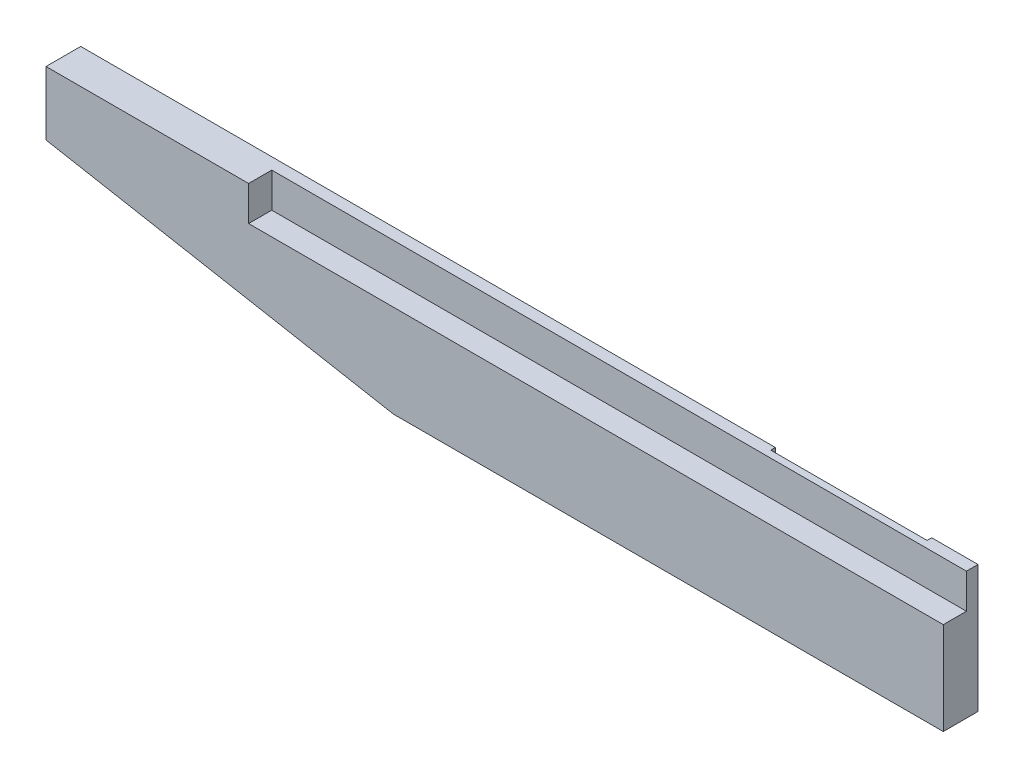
from build123d import *

# Parameters (mm, degrees)
BOSS_EXTRUDE1_DEPTH     = 69.85
CUT_EXTRUDE3_DEPTH      = 498.422296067
CUT_EXTRUDE3_DEPTH_BACK = 498.422296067
SKETCH5_W               = 12.7
SKETCH5_H               = 19.05
CUT_EXTRUDE4_DEPTH      = 381


with BuildPart() as part:
    # Sketch1 → Boss-Extrude1 (new body)
    with BuildSketch(Plane(origin=(0, 0, 0), x_dir=(1, 0, 0), z_dir=(0, 1, 0))):
        Polygon((0, 19.05), (-25.4, 19.05), (-25.4, 16.51), (-111.125, 16.51), (-111.125, 19.05), (-492.125, 19.05), (-492.125, 0), (0, 0), align=None)
    extrude(amount=BOSS_EXTRUDE1_DEPTH)

    # Sketch4 → Cut-Extrude3 (cut, two sides: drawn at the far end of the back side and taken through both)
    with BuildSketch(Plane(origin=(0, 0, -19.05), x_dir=(-1, 0, 0), z_dir=(0, 0, -1)).offset(-CUT_EXTRUDE3_DEPTH_BACK)):
        Polygon((1472.510674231, 214.662373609), (492.125, 34.925), (301.625, 0), (-678.760674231, -179.737373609), (-319.285927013, -2140.508722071), (1831.985421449, -1746.108974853), align=None)
    extrude(amount=CUT_EXTRUDE3_DEPTH + CUT_EXTRUDE3_DEPTH_BACK, mode=Mode.SUBTRACT)

    # Sketch5 → Cut-Extrude4 (cut)
    with BuildSketch(Plane(origin=(0, 0, 0), x_dir=(0, 0, -1), z_dir=(1, 0, 0))):
        with Locations((6.35, 60.325)):
            Rectangle(SKETCH5_W, SKETCH5_H)
    extrude(amount=-CUT_EXTRUDE4_DEPTH, mode=Mode.SUBTRACT)


solid = part.part
